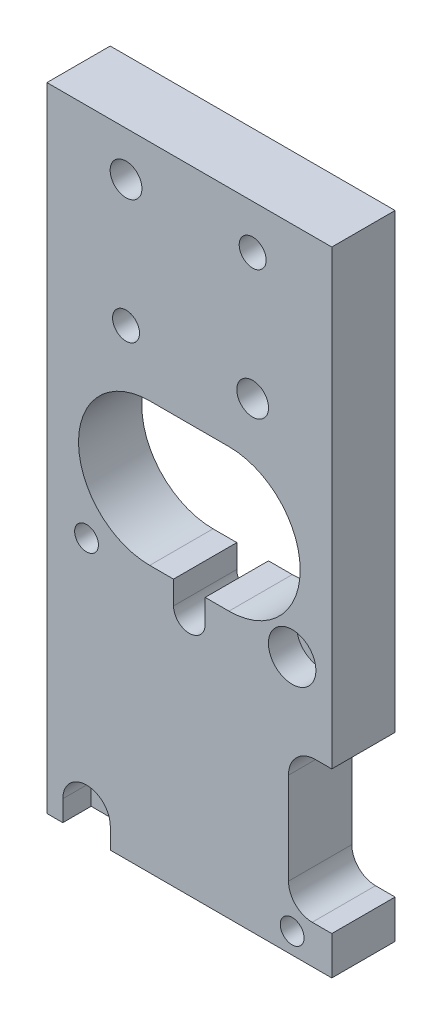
ISO-10303-21;
HEADER;
FILE_DESCRIPTION(('STEP AP214'),'2;1');
FILE_NAME('part.step','',(''),(''),'','','');
FILE_SCHEMA(('AUTOMOTIVE_DESIGN { 1 0 10303 214 1 1 1 1 }'));
ENDSEC;
DATA;
#1=APPLICATION_CONTEXT('core data for automotive mechanical design processes');
#2=APPLICATION_PROTOCOL_DEFINITION('international standard','automotive_design',2000,#1);
#3=PRODUCT_CONTEXT('',#1,'mechanical');
#4=PRODUCT('Part','Part','',(#3));
#5=PRODUCT_RELATED_PRODUCT_CATEGORY('part','',(#4));
#6=PRODUCT_DEFINITION_FORMATION('','',#4);
#7=PRODUCT_DEFINITION_CONTEXT('part definition',#1,'design');
#8=PRODUCT_DEFINITION('design','',#6,#7);
#9=PRODUCT_DEFINITION_SHAPE('','',#8);
#10=(LENGTH_UNIT() NAMED_UNIT(*) SI_UNIT(.MILLI.,.METRE.));
#11=(NAMED_UNIT(*) PLANE_ANGLE_UNIT() SI_UNIT($,.RADIAN.));
#12=(NAMED_UNIT(*) SI_UNIT($,.STERADIAN.) SOLID_ANGLE_UNIT());
#13=UNCERTAINTY_MEASURE_WITH_UNIT(LENGTH_MEASURE(1.E-05),#10,'distance_accuracy_value','');
#14=(GEOMETRIC_REPRESENTATION_CONTEXT(3) GLOBAL_UNCERTAINTY_ASSIGNED_CONTEXT((#13)) GLOBAL_UNIT_ASSIGNED_CONTEXT((#10,
#11,#12)) REPRESENTATION_CONTEXT('',''));
#15=CARTESIAN_POINT('',(0.,0.,0.));
#16=DIRECTION('',(0.,0.,1.));
#17=DIRECTION('',(1.,0.,0.));
#18=AXIS2_PLACEMENT_3D('',#15,#16,#17);
#19=CARTESIAN_POINT('',(14.2875,31.75,-6.35));
#20=DIRECTION('',(1.,0.,0.));
#21=DIRECTION('',(0.,1.,0.));
#22=AXIS2_PLACEMENT_3D('',#19,#20,#21);
#23=PLANE('',#22);
#24=DIRECTION('',(0.,1.,0.));
#25=VECTOR('',#24,1.);
#26=CARTESIAN_POINT('',(14.2875,31.75,0.));
#27=LINE('',#26,#25);
#28=CARTESIAN_POINT('',(14.2875,-13.589,0.));
#29=VERTEX_POINT('',#28);
#30=CARTESIAN_POINT('',(14.2875,31.75,0.));
#31=VERTEX_POINT('',#30);
#32=EDGE_CURVE('E397',#29,#31,#27,.T.);
#33=ORIENTED_EDGE('',*,*,#32,.F.);
#34=DIRECTION('',(0.,0.,1.));
#35=VECTOR('',#34,1.);
#36=CARTESIAN_POINT('',(14.2875,-13.589,-6.35));
#37=LINE('',#36,#35);
#38=CARTESIAN_POINT('',(14.2875,-13.589,-6.35));
#39=VERTEX_POINT('',#38);
#40=EDGE_CURVE('E230',#39,#29,#37,.T.);
#41=ORIENTED_EDGE('',*,*,#40,.F.);
#42=DIRECTION('',(0.,1.,0.));
#43=VECTOR('',#42,1.);
#44=CARTESIAN_POINT('',(14.2875,31.75,-6.35));
#45=LINE('',#44,#43);
#46=CARTESIAN_POINT('',(14.2875,31.75,-6.35));
#47=VERTEX_POINT('',#46);
#48=EDGE_CURVE('E383',#39,#47,#45,.T.);
#49=ORIENTED_EDGE('',*,*,#48,.T.);
#50=DIRECTION('',(0.,0.,1.));
#51=VECTOR('',#50,1.);
#52=CARTESIAN_POINT('',(14.2875,31.75,-6.35));
#53=LINE('',#52,#51);
#54=EDGE_CURVE('E44',#47,#31,#53,.T.);
#55=ORIENTED_EDGE('',*,*,#54,.T.);
#56=EDGE_LOOP('',(#33,#41,#49,#55));
#57=FACE_BOUND('',#56,.T.);
#58=ADVANCED_FACE('F35',(#57),#23,.T.);
#59=CARTESIAN_POINT('',(14.2875,-31.75,-6.35));
#60=VERTEX_POINT('',#59);
#61=CARTESIAN_POINT('',(14.2875,-27.8892,-6.35));
#62=VERTEX_POINT('',#61);
#63=EDGE_CURVE('E384',#60,#62,#45,.T.);
#64=ORIENTED_EDGE('',*,*,#63,.T.);
#65=DIRECTION('',(0.,0.,1.));
#66=VECTOR('',#65,1.);
#67=CARTESIAN_POINT('',(14.2875,-27.8892,-6.35));
#68=LINE('',#67,#66);
#69=CARTESIAN_POINT('',(14.2875,-27.8892,0.));
#70=VERTEX_POINT('',#69);
#71=EDGE_CURVE('E232',#62,#70,#68,.T.);
#72=ORIENTED_EDGE('',*,*,#71,.T.);
#73=CARTESIAN_POINT('',(14.2875,-31.75,0.));
#74=VERTEX_POINT('',#73);
#75=EDGE_CURVE('E398',#74,#70,#27,.T.);
#76=ORIENTED_EDGE('',*,*,#75,.F.);
#77=DIRECTION('',(0.,0.,1.));
#78=VECTOR('',#77,1.);
#79=CARTESIAN_POINT('',(14.2875,-31.75,-6.35));
#80=LINE('',#79,#78);
#81=EDGE_CURVE('E405',#60,#74,#80,.T.);
#82=ORIENTED_EDGE('',*,*,#81,.F.);
#83=EDGE_LOOP('',(#64,#72,#76,#82));
#84=FACE_BOUND('',#83,.T.);
#85=ADVANCED_FACE('F431',(#84),#23,.T.);
#86=CARTESIAN_POINT('',(-14.2875,-31.75,-6.35));
#87=DIRECTION('',(0.,0.,1.));
#88=DIRECTION('',(1.,0.,0.));
#89=AXIS2_PLACEMENT_3D('',#86,#87,#88);
#90=PLANE('',#89);
#91=CARTESIAN_POINT('',(-6.35,27.305,-6.35));
#92=DIRECTION('',(0.,0.,1.));
#93=DIRECTION('',(1.,0.,0.));
#94=AXIS2_PLACEMENT_3D('',#91,#92,#93);
#95=CIRCLE('',#94,1.59385);
#96=CARTESIAN_POINT('',(-4.75615,27.305,-6.35));
#97=VERTEX_POINT('',#96);
#98=EDGE_CURVE('E370',#97,#97,#95,.T.);
#99=ORIENTED_EDGE('',*,*,#98,.T.);
#100=EDGE_LOOP('',(#99));
#101=FACE_BOUND('',#100,.T.);
#102=CARTESIAN_POINT('',(6.35,14.605,-6.35));
#103=DIRECTION('',(0.,0.,1.));
#104=DIRECTION('',(1.,0.,0.));
#105=AXIS2_PLACEMENT_3D('',#102,#103,#104);
#106=CIRCLE('',#105,1.59385);
#107=CARTESIAN_POINT('',(7.94385,14.605,-6.35));
#108=VERTEX_POINT('',#107);
#109=EDGE_CURVE('E364',#108,#108,#106,.T.);
#110=ORIENTED_EDGE('',*,*,#109,.T.);
#111=EDGE_LOOP('',(#110));
#112=FACE_BOUND('',#111,.T.);
#113=DIRECTION('',(1.,0.,0.));
#114=VECTOR('',#113,1.);
#115=CARTESIAN_POINT('',(-1.5875,-5.03554999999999,-6.35));
#116=LINE('',#115,#114);
#117=CARTESIAN_POINT('',(-3.9751,-5.03555,-6.35));
#118=VERTEX_POINT('',#117);
#119=CARTESIAN_POINT('',(-1.5875,-5.03554999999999,-6.35));
#120=VERTEX_POINT('',#119);
#121=EDGE_CURVE('E297',#118,#120,#116,.T.);
#122=ORIENTED_EDGE('',*,*,#121,.T.);
#123=DIRECTION('',(0.,-1.,0.));
#124=VECTOR('',#123,1.);
#125=CARTESIAN_POINT('',(-1.5875,-7.36599999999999,-6.35));
#126=LINE('',#125,#124);
#127=CARTESIAN_POINT('',(-1.5875,-7.36599999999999,-6.35));
#128=VERTEX_POINT('',#127);
#129=EDGE_CURVE('E300',#120,#128,#126,.T.);
#130=ORIENTED_EDGE('',*,*,#129,.T.);
#131=CARTESIAN_POINT('',(0.,-7.36599999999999,-6.35));
#132=DIRECTION('',(0.,0.,1.));
#133=DIRECTION('',(1.,0.,0.));
#134=AXIS2_PLACEMENT_3D('',#131,#132,#133);
#135=CIRCLE('',#134,1.5875);
#136=CARTESIAN_POINT('',(1.5875,-7.36599999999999,-6.35));
#137=VERTEX_POINT('',#136);
#138=EDGE_CURVE('E358',#128,#137,#135,.T.);
#139=ORIENTED_EDGE('',*,*,#138,.T.);
#140=DIRECTION('',(0.,1.,0.));
#141=VECTOR('',#140,1.);
#142=CARTESIAN_POINT('',(1.5875,-7.36599999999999,-6.35));
#143=LINE('',#142,#141);
#144=CARTESIAN_POINT('',(1.5875,-5.03554999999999,-6.35));
#145=VERTEX_POINT('',#144);
#146=EDGE_CURVE('E281',#137,#145,#143,.T.);
#147=ORIENTED_EDGE('',*,*,#146,.T.);
#148=DIRECTION('',(1.,0.,0.));
#149=VECTOR('',#148,1.);
#150=CARTESIAN_POINT('',(3.9751,-5.03554999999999,-6.35));
#151=LINE('',#150,#149);
#152=CARTESIAN_POINT('',(3.9751,-5.03555000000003,-6.35));
#153=VERTEX_POINT('',#152);
#154=EDGE_CURVE('E284',#145,#153,#151,.T.);
#155=ORIENTED_EDGE('',*,*,#154,.T.);
#156=CARTESIAN_POINT('',(3.9751,2.1082,-6.35));
#157=DIRECTION('',(0.,0.,1.));
#158=DIRECTION('',(1.,0.,0.));
#159=AXIS2_PLACEMENT_3D('',#156,#157,#158);
#160=CIRCLE('',#159,7.14375000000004);
#161=CARTESIAN_POINT('',(3.9751,9.25195000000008,-6.35));
#162=VERTEX_POINT('',#161);
#163=EDGE_CURVE('E288',#153,#162,#160,.T.);
#164=ORIENTED_EDGE('',*,*,#163,.T.);
#165=DIRECTION('',(-1.,0.,0.));
#166=VECTOR('',#165,1.);
#167=CARTESIAN_POINT('',(-3.9751,9.25195000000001,-6.35));
#168=LINE('',#167,#166);
#169=CARTESIAN_POINT('',(-3.9751,9.25195000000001,-6.35));
#170=VERTEX_POINT('',#169);
#171=EDGE_CURVE('E291',#162,#170,#168,.T.);
#172=ORIENTED_EDGE('',*,*,#171,.T.);
#173=CARTESIAN_POINT('',(-3.9751,2.1082,-6.35));
#174=DIRECTION('',(0.,0.,1.));
#175=DIRECTION('',(1.,0.,0.));
#176=AXIS2_PLACEMENT_3D('',#173,#174,#175);
#177=CIRCLE('',#176,7.14375);
#178=EDGE_CURVE('E294',#170,#118,#177,.T.);
#179=ORIENTED_EDGE('',*,*,#178,.T.);
#180=EDGE_LOOP('',(#122,#130,#139,#147,#155,#164,#172,#179));
#181=FACE_BOUND('',#180,.T.);
#182=CARTESIAN_POINT('',(-10.3124,-5.842,-6.35));
#183=DIRECTION('',(0.,0.,1.));
#184=DIRECTION('',(1.,0.,0.));
#185=AXIS2_PLACEMENT_3D('',#182,#183,#184);
#186=CIRCLE('',#185,1.1938);
#187=CARTESIAN_POINT('',(-9.1186,-5.842,-6.35));
#188=VERTEX_POINT('',#187);
#189=EDGE_CURVE('E352',#188,#188,#186,.T.);
#190=ORIENTED_EDGE('',*,*,#189,.T.);
#191=EDGE_LOOP('',(#190));
#192=FACE_BOUND('',#191,.T.);
#193=CARTESIAN_POINT('',(10.3124,-29.6672,-6.35));
#194=DIRECTION('',(0.,0.,1.));
#195=DIRECTION('',(1.,0.,0.));
#196=AXIS2_PLACEMENT_3D('',#193,#194,#195);
#197=CIRCLE('',#196,1.1938);
#198=CARTESIAN_POINT('',(11.5062,-29.6672,-6.35));
#199=VERTEX_POINT('',#198);
#200=EDGE_CURVE('E346',#199,#199,#197,.T.);
#201=ORIENTED_EDGE('',*,*,#200,.T.);
#202=EDGE_LOOP('',(#201));
#203=FACE_BOUND('',#202,.T.);
#204=CARTESIAN_POINT('',(10.3124,-5.842,-6.35));
#205=DIRECTION('',(0.,0.,1.));
#206=DIRECTION('',(1.,0.,0.));
#207=AXIS2_PLACEMENT_3D('',#204,#205,#206);
#208=CIRCLE('',#207,1.4351);
#209=CARTESIAN_POINT('',(11.7475,-5.842,-6.35));
#210=VERTEX_POINT('',#209);
#211=EDGE_CURVE('E342',#210,#210,#208,.T.);
#212=ORIENTED_EDGE('',*,*,#211,.T.);
#213=EDGE_LOOP('',(#212));
#214=FACE_BOUND('',#213,.T.);
#215=CARTESIAN_POINT('',(-10.3124,-29.6672,-6.35));
#216=DIRECTION('',(0.,0.,1.));
#217=DIRECTION('',(1.,0.,0.));
#218=AXIS2_PLACEMENT_3D('',#215,#216,#217);
#219=CIRCLE('',#218,1.4351);
#220=CARTESIAN_POINT('',(-8.8773,-29.6672,-6.35));
#221=VERTEX_POINT('',#220);
#222=EDGE_CURVE('E326',#221,#221,#219,.T.);
#223=ORIENTED_EDGE('',*,*,#222,.T.);
#224=EDGE_LOOP('',(#223));
#225=FACE_BOUND('',#224,.T.);
#226=CARTESIAN_POINT('',(6.35,27.305,-6.35));
#227=DIRECTION('',(0.,0.,1.));
#228=DIRECTION('',(1.,0.,0.));
#229=AXIS2_PLACEMENT_3D('',#226,#227,#228);
#230=CIRCLE('',#229,1.35255);
#231=CARTESIAN_POINT('',(7.70255,27.305,-6.35));
#232=VERTEX_POINT('',#231);
#233=EDGE_CURVE('E241',#232,#232,#230,.T.);
#234=ORIENTED_EDGE('',*,*,#233,.T.);
#235=EDGE_LOOP('',(#234));
#236=FACE_BOUND('',#235,.T.);
#237=CARTESIAN_POINT('',(-6.35,14.605,-6.35));
#238=DIRECTION('',(0.,0.,1.));
#239=DIRECTION('',(1.,0.,0.));
#240=AXIS2_PLACEMENT_3D('',#237,#238,#239);
#241=CIRCLE('',#240,1.35255);
#242=CARTESIAN_POINT('',(-4.99745,14.605,-6.35));
#243=VERTEX_POINT('',#242);
#244=EDGE_CURVE('E227',#243,#243,#241,.T.);
#245=ORIENTED_EDGE('',*,*,#244,.T.);
#246=EDGE_LOOP('',(#245));
#247=FACE_BOUND('',#246,.T.);
#248=DIRECTION('',(1.,0.,0.));
#249=VECTOR('',#248,1.);
#250=CARTESIAN_POINT('',(0.,-13.5889999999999,-6.35));
#251=LINE('',#250,#249);
#252=CARTESIAN_POINT('',(12.6609873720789,-13.589,-6.35));
#253=VERTEX_POINT('',#252);
#254=EDGE_CURVE('E214',#253,#39,#251,.T.);
#255=ORIENTED_EDGE('',*,*,#254,.F.);
#256=CARTESIAN_POINT('',(12.6576066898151,-16.3025045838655,-6.35));
#257=DIRECTION('',(0.,0.,1.));
#258=DIRECTION('',(1.,0.,0.));
#259=AXIS2_PLACEMENT_3D('',#256,#257,#258);
#260=CIRCLE('',#259,2.71350668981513);
#261=CARTESIAN_POINT('',(9.94410000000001,-16.3025045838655,-6.35));
#262=VERTEX_POINT('',#261);
#263=EDGE_CURVE('E194',#253,#262,#260,.T.);
#264=ORIENTED_EDGE('',*,*,#263,.T.);
#265=DIRECTION('',(0.,-1.,0.));
#266=VECTOR('',#265,1.);
#267=CARTESIAN_POINT('',(9.94410000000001,0.,-6.35));
#268=LINE('',#267,#266);
#269=CARTESIAN_POINT('',(9.94410000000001,-25.50922,-6.35));
#270=VERTEX_POINT('',#269);
#271=EDGE_CURVE('E188',#262,#270,#268,.T.);
#272=ORIENTED_EDGE('',*,*,#271,.T.);
#273=CARTESIAN_POINT('',(12.32408,-25.50922,-6.35));
#274=DIRECTION('',(0.,0.,1.));
#275=DIRECTION('',(1.,0.,0.));
#276=AXIS2_PLACEMENT_3D('',#273,#274,#275);
#277=CIRCLE('',#276,2.37998);
#278=CARTESIAN_POINT('',(12.32408,-27.8892,-6.35));
#279=VERTEX_POINT('',#278);
#280=EDGE_CURVE('E198',#270,#279,#277,.T.);
#281=ORIENTED_EDGE('',*,*,#280,.T.);
#282=DIRECTION('',(-1.,0.,0.));
#283=VECTOR('',#282,1.);
#284=CARTESIAN_POINT('',(0.,-27.8892,-6.35));
#285=LINE('',#284,#283);
#286=EDGE_CURVE('E202',#62,#279,#285,.T.);
#287=ORIENTED_EDGE('',*,*,#286,.F.);
#288=ORIENTED_EDGE('',*,*,#63,.F.);
#289=DIRECTION('',(1.,0.,0.));
#290=VECTOR('',#289,1.);
#291=CARTESIAN_POINT('',(-14.2875,-31.75,-6.35));
#292=LINE('',#291,#290);
#293=CARTESIAN_POINT('',(-14.2875,-31.75,-6.35));
#294=VERTEX_POINT('',#293);
#295=EDGE_CURVE('E379',#294,#60,#292,.T.);
#296=ORIENTED_EDGE('',*,*,#295,.F.);
#297=DIRECTION('',(0.,-1.,0.));
#298=VECTOR('',#297,1.);
#299=CARTESIAN_POINT('',(-14.2875,31.75,-6.35));
#300=LINE('',#299,#298);
#301=CARTESIAN_POINT('',(-14.2875,31.75,-6.35));
#302=VERTEX_POINT('',#301);
#303=EDGE_CURVE('E376',#302,#294,#300,.T.);
#304=ORIENTED_EDGE('',*,*,#303,.F.);
#305=DIRECTION('',(-1.,0.,0.));
#306=VECTOR('',#305,1.);
#307=CARTESIAN_POINT('',(-14.2875,31.75,-6.35));
#308=LINE('',#307,#306);
#309=EDGE_CURVE('E387',#47,#302,#308,.T.);
#310=ORIENTED_EDGE('',*,*,#309,.F.);
#311=ORIENTED_EDGE('',*,*,#48,.F.);
#312=EDGE_LOOP('',(#255,#264,#272,#281,#287,#288,#296,#304,#310,#311));
#313=FACE_BOUND('',#312,.T.);
#314=ADVANCED_FACE('F205',(#101,#112,#181,#192,#203,#214,#225,#236,#247,#313),#90,.F.);
#315=CARTESIAN_POINT('',(-14.2875,-31.75,0.));
#316=DIRECTION('',(0.,0.,1.));
#317=DIRECTION('',(1.,0.,0.));
#318=AXIS2_PLACEMENT_3D('',#315,#316,#317);
#319=PLANE('',#318);
#320=CARTESIAN_POINT('',(-6.35,27.305,0.));
#321=DIRECTION('',(0.,0.,1.));
#322=DIRECTION('',(1.,0.,0.));
#323=AXIS2_PLACEMENT_3D('',#320,#321,#322);
#324=CIRCLE('',#323,1.59385);
#325=CARTESIAN_POINT('',(-4.75615,27.305,0.));
#326=VERTEX_POINT('',#325);
#327=EDGE_CURVE('E367',#326,#326,#324,.T.);
#328=ORIENTED_EDGE('',*,*,#327,.F.);
#329=EDGE_LOOP('',(#328));
#330=FACE_BOUND('',#329,.T.);
#331=CARTESIAN_POINT('',(6.35,14.605,0.));
#332=DIRECTION('',(0.,0.,1.));
#333=DIRECTION('',(1.,0.,0.));
#334=AXIS2_PLACEMENT_3D('',#331,#332,#333);
#335=CIRCLE('',#334,1.59385);
#336=CARTESIAN_POINT('',(7.94385,14.605,0.));
#337=VERTEX_POINT('',#336);
#338=EDGE_CURVE('E361',#337,#337,#335,.T.);
#339=ORIENTED_EDGE('',*,*,#338,.F.);
#340=EDGE_LOOP('',(#339));
#341=FACE_BOUND('',#340,.T.);
#342=CARTESIAN_POINT('',(-10.3124,-5.842,0.));
#343=DIRECTION('',(0.,0.,1.));
#344=DIRECTION('',(1.,0.,0.));
#345=AXIS2_PLACEMENT_3D('',#342,#343,#344);
#346=CIRCLE('',#345,1.1938);
#347=CARTESIAN_POINT('',(-9.1186,-5.842,0.));
#348=VERTEX_POINT('',#347);
#349=EDGE_CURVE('E349',#348,#348,#346,.T.);
#350=ORIENTED_EDGE('',*,*,#349,.F.);
#351=EDGE_LOOP('',(#350));
#352=FACE_BOUND('',#351,.T.);
#353=CARTESIAN_POINT('',(10.3124,-29.6672,0.));
#354=DIRECTION('',(0.,0.,1.));
#355=DIRECTION('',(1.,0.,0.));
#356=AXIS2_PLACEMENT_3D('',#353,#354,#355);
#357=CIRCLE('',#356,1.1938);
#358=CARTESIAN_POINT('',(11.5062,-29.6672,0.));
#359=VERTEX_POINT('',#358);
#360=EDGE_CURVE('E345',#359,#359,#357,.T.);
#361=ORIENTED_EDGE('',*,*,#360,.F.);
#362=EDGE_LOOP('',(#361));
#363=FACE_BOUND('',#362,.T.);
#364=DIRECTION('',(0.,-1.,0.));
#365=VECTOR('',#364,1.);
#366=CARTESIAN_POINT('',(-1.5875,-7.36599999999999,0.));
#367=LINE('',#366,#365);
#368=CARTESIAN_POINT('',(-1.5875,-5.03554999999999,0.));
#369=VERTEX_POINT('',#368);
#370=CARTESIAN_POINT('',(-1.5875,-7.36599999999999,0.));
#371=VERTEX_POINT('',#370);
#372=EDGE_CURVE('E285',#369,#371,#367,.T.);
#373=ORIENTED_EDGE('',*,*,#372,.F.);
#374=DIRECTION('',(1.,0.,0.));
#375=VECTOR('',#374,1.);
#376=CARTESIAN_POINT('',(-1.5875,-5.03554999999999,0.));
#377=LINE('',#376,#375);
#378=CARTESIAN_POINT('',(-3.9751,-5.03555,0.));
#379=VERTEX_POINT('',#378);
#380=EDGE_CURVE('E319',#379,#369,#377,.T.);
#381=ORIENTED_EDGE('',*,*,#380,.F.);
#382=CARTESIAN_POINT('',(-3.9751,2.1082,0.));
#383=DIRECTION('',(0.,0.,1.));
#384=DIRECTION('',(1.,0.,0.));
#385=AXIS2_PLACEMENT_3D('',#382,#383,#384);
#386=CIRCLE('',#385,7.14375);
#387=CARTESIAN_POINT('',(-3.9751,9.25195000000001,0.));
#388=VERTEX_POINT('',#387);
#389=EDGE_CURVE('E316',#388,#379,#386,.T.);
#390=ORIENTED_EDGE('',*,*,#389,.F.);
#391=DIRECTION('',(-1.,0.,0.));
#392=VECTOR('',#391,1.);
#393=CARTESIAN_POINT('',(-3.9751,9.25195000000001,0.));
#394=LINE('',#393,#392);
#395=CARTESIAN_POINT('',(3.9751,9.25195000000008,0.));
#396=VERTEX_POINT('',#395);
#397=EDGE_CURVE('E313',#396,#388,#394,.T.);
#398=ORIENTED_EDGE('',*,*,#397,.F.);
#399=CARTESIAN_POINT('',(3.9751,2.1082,0.));
#400=DIRECTION('',(0.,0.,1.));
#401=DIRECTION('',(1.,0.,0.));
#402=AXIS2_PLACEMENT_3D('',#399,#400,#401);
#403=CIRCLE('',#402,7.14375000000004);
#404=CARTESIAN_POINT('',(3.9751,-5.03555000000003,0.));
#405=VERTEX_POINT('',#404);
#406=EDGE_CURVE('E310',#405,#396,#403,.T.);
#407=ORIENTED_EDGE('',*,*,#406,.F.);
#408=DIRECTION('',(1.,0.,0.));
#409=VECTOR('',#408,1.);
#410=CARTESIAN_POINT('',(3.9751,-5.03554999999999,0.));
#411=LINE('',#410,#409);
#412=CARTESIAN_POINT('',(1.5875,-5.03554999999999,0.));
#413=VERTEX_POINT('',#412);
#414=EDGE_CURVE('E307',#413,#405,#411,.T.);
#415=ORIENTED_EDGE('',*,*,#414,.F.);
#416=DIRECTION('',(0.,1.,0.));
#417=VECTOR('',#416,1.);
#418=CARTESIAN_POINT('',(1.5875,-7.36599999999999,0.));
#419=LINE('',#418,#417);
#420=CARTESIAN_POINT('',(1.5875,-7.36599999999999,0.));
#421=VERTEX_POINT('',#420);
#422=EDGE_CURVE('E304',#421,#413,#419,.T.);
#423=ORIENTED_EDGE('',*,*,#422,.F.);
#424=CARTESIAN_POINT('',(0.,-7.36599999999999,0.));
#425=DIRECTION('',(0.,0.,1.));
#426=DIRECTION('',(1.,0.,0.));
#427=AXIS2_PLACEMENT_3D('',#424,#425,#426);
#428=CIRCLE('',#427,1.5875);
#429=EDGE_CURVE('E355',#371,#421,#428,.T.);
#430=ORIENTED_EDGE('',*,*,#429,.F.);
#431=EDGE_LOOP('',(#373,#381,#390,#398,#407,#415,#423,#430));
#432=FACE_BOUND('',#431,.T.);
#433=CARTESIAN_POINT('',(10.3124,-5.842,0.));
#434=DIRECTION('',(0.,0.,1.));
#435=DIRECTION('',(1.,0.,0.));
#436=AXIS2_PLACEMENT_3D('',#433,#434,#435);
#437=CIRCLE('',#436,2.38125);
#438=CARTESIAN_POINT('',(12.69365,-5.842,0.));
#439=VERTEX_POINT('',#438);
#440=EDGE_CURVE('E247',#439,#439,#437,.T.);
#441=ORIENTED_EDGE('',*,*,#440,.F.);
#442=EDGE_LOOP('',(#441));
#443=FACE_BOUND('',#442,.T.);
#444=CARTESIAN_POINT('',(6.35,27.305,0.));
#445=DIRECTION('',(0.,0.,1.));
#446=DIRECTION('',(1.,0.,0.));
#447=AXIS2_PLACEMENT_3D('',#444,#445,#446);
#448=CIRCLE('',#447,1.35254999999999);
#449=CARTESIAN_POINT('',(7.70254999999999,27.305,0.));
#450=VERTEX_POINT('',#449);
#451=EDGE_CURVE('E244',#450,#450,#448,.T.);
#452=ORIENTED_EDGE('',*,*,#451,.F.);
#453=EDGE_LOOP('',(#452));
#454=FACE_BOUND('',#453,.T.);
#455=CARTESIAN_POINT('',(-6.35,14.605,0.));
#456=DIRECTION('',(0.,0.,1.));
#457=DIRECTION('',(1.,0.,0.));
#458=AXIS2_PLACEMENT_3D('',#455,#456,#457);
#459=CIRCLE('',#458,1.35254999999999);
#460=CARTESIAN_POINT('',(-4.99745000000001,14.605,0.));
#461=VERTEX_POINT('',#460);
#462=EDGE_CURVE('E238',#461,#461,#459,.T.);
#463=ORIENTED_EDGE('',*,*,#462,.F.);
#464=EDGE_LOOP('',(#463));
#465=FACE_BOUND('',#464,.T.);
#466=CARTESIAN_POINT('',(12.6576066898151,-16.3025045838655,0.));
#467=DIRECTION('',(0.,0.,1.));
#468=DIRECTION('',(1.,0.,0.));
#469=AXIS2_PLACEMENT_3D('',#466,#467,#468);
#470=CIRCLE('',#469,2.71350668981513);
#471=CARTESIAN_POINT('',(12.6609873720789,-13.589,0.));
#472=VERTEX_POINT('',#471);
#473=CARTESIAN_POINT('',(9.94410000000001,-16.3025045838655,0.));
#474=VERTEX_POINT('',#473);
#475=EDGE_CURVE('E207',#472,#474,#470,.T.);
#476=ORIENTED_EDGE('',*,*,#475,.F.);
#477=DIRECTION('',(1.,0.,0.));
#478=VECTOR('',#477,1.);
#479=CARTESIAN_POINT('',(0.,-13.5889999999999,0.));
#480=LINE('',#479,#478);
#481=EDGE_CURVE('E210',#472,#29,#480,.T.);
#482=ORIENTED_EDGE('',*,*,#481,.T.);
#483=ORIENTED_EDGE('',*,*,#32,.T.);
#484=DIRECTION('',(-1.,0.,0.));
#485=VECTOR('',#484,1.);
#486=CARTESIAN_POINT('',(-14.2875,31.75,0.));
#487=LINE('',#486,#485);
#488=CARTESIAN_POINT('',(-14.2875,31.75,0.));
#489=VERTEX_POINT('',#488);
#490=EDGE_CURVE('E380',#31,#489,#487,.T.);
#491=ORIENTED_EDGE('',*,*,#490,.T.);
#492=DIRECTION('',(0.,-1.,0.));
#493=VECTOR('',#492,1.);
#494=CARTESIAN_POINT('',(-14.2875,31.75,0.));
#495=LINE('',#494,#493);
#496=CARTESIAN_POINT('',(-14.2875,-31.75,0.));
#497=VERTEX_POINT('',#496);
#498=EDGE_CURVE('E373',#489,#497,#495,.T.);
#499=ORIENTED_EDGE('',*,*,#498,.T.);
#500=DIRECTION('',(1.,0.,0.));
#501=VECTOR('',#500,1.);
#502=CARTESIAN_POINT('',(-14.2875,-31.75,0.));
#503=LINE('',#502,#501);
#504=CARTESIAN_POINT('',(-12.69365,-31.75,0.));
#505=VERTEX_POINT('',#504);
#506=EDGE_CURVE('E394',#497,#505,#503,.T.);
#507=ORIENTED_EDGE('',*,*,#506,.T.);
#508=DIRECTION('',(0.,-1.,0.));
#509=VECTOR('',#508,1.);
#510=CARTESIAN_POINT('',(-12.69365,-29.6672,0.));
#511=LINE('',#510,#509);
#512=CARTESIAN_POINT('',(-12.69365,-29.6672,0.));
#513=VERTEX_POINT('',#512);
#514=EDGE_CURVE('E257',#513,#505,#511,.T.);
#515=ORIENTED_EDGE('',*,*,#514,.F.);
#516=CARTESIAN_POINT('',(-10.3124,-29.6672,0.));
#517=DIRECTION('',(0.,0.,1.));
#518=DIRECTION('',(1.,0.,0.));
#519=AXIS2_PLACEMENT_3D('',#516,#517,#518);
#520=CIRCLE('',#519,2.38125);
#521=CARTESIAN_POINT('',(-7.93115,-29.6672,0.));
#522=VERTEX_POINT('',#521);
#523=EDGE_CURVE('E268',#522,#513,#520,.T.);
#524=ORIENTED_EDGE('',*,*,#523,.F.);
#525=DIRECTION('',(0.,1.,0.));
#526=VECTOR('',#525,1.);
#527=CARTESIAN_POINT('',(-7.93115,-31.75,0.));
#528=LINE('',#527,#526);
#529=CARTESIAN_POINT('',(-7.93115,-31.75,0.));
#530=VERTEX_POINT('',#529);
#531=EDGE_CURVE('E266',#530,#522,#528,.T.);
#532=ORIENTED_EDGE('',*,*,#531,.F.);
#533=EDGE_CURVE('E393',#530,#74,#503,.T.);
#534=ORIENTED_EDGE('',*,*,#533,.T.);
#535=ORIENTED_EDGE('',*,*,#75,.T.);
#536=DIRECTION('',(-1.,0.,0.));
#537=VECTOR('',#536,1.);
#538=CARTESIAN_POINT('',(0.,-27.8892,0.));
#539=LINE('',#538,#537);
#540=CARTESIAN_POINT('',(12.32408,-27.8892,0.));
#541=VERTEX_POINT('',#540);
#542=EDGE_CURVE('E220',#70,#541,#539,.T.);
#543=ORIENTED_EDGE('',*,*,#542,.T.);
#544=CARTESIAN_POINT('',(12.32408,-25.50922,0.));
#545=DIRECTION('',(0.,0.,1.));
#546=DIRECTION('',(1.,0.,0.));
#547=AXIS2_PLACEMENT_3D('',#544,#545,#546);
#548=CIRCLE('',#547,2.37998);
#549=CARTESIAN_POINT('',(9.94410000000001,-25.50922,0.));
#550=VERTEX_POINT('',#549);
#551=EDGE_CURVE('E218',#550,#541,#548,.T.);
#552=ORIENTED_EDGE('',*,*,#551,.F.);
#553=DIRECTION('',(0.,-1.,0.));
#554=VECTOR('',#553,1.);
#555=CARTESIAN_POINT('',(9.94410000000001,0.,0.));
#556=LINE('',#555,#554);
#557=EDGE_CURVE('E52',#474,#550,#556,.T.);
#558=ORIENTED_EDGE('',*,*,#557,.F.);
#559=EDGE_LOOP('',(#476,#482,#483,#491,#499,#507,#515,#524,#532,#534,#535,#543,#552,#558));
#560=FACE_BOUND('',#559,.T.);
#561=ADVANCED_FACE('F425',(#330,#341,#352,#363,#432,#443,#454,#465,#560),#319,.T.);
#562=CARTESIAN_POINT('',(10.3124,-5.842,-6.35));
#563=DIRECTION('',(0.,0.,1.));
#564=DIRECTION('',(1.,0.,0.));
#565=AXIS2_PLACEMENT_3D('',#562,#563,#564);
#566=CYLINDRICAL_SURFACE('',#565,1.4351);
#567=ORIENTED_EDGE('',*,*,#211,.F.);
#568=EDGE_LOOP('',(#567));
#569=FACE_BOUND('',#568,.T.);
#570=CARTESIAN_POINT('',(10.3124,-5.842,-2.8448));
#571=DIRECTION('',(0.,0.,1.));
#572=DIRECTION('',(1.,0.,0.));
#573=AXIS2_PLACEMENT_3D('',#570,#571,#572);
#574=CIRCLE('',#573,1.4351);
#575=CARTESIAN_POINT('',(11.7475,-5.842,-2.8448));
#576=VERTEX_POINT('',#575);
#577=EDGE_CURVE('E39',#576,#576,#574,.F.);
#578=ORIENTED_EDGE('',*,*,#577,.F.);
#579=EDGE_LOOP('',(#578));
#580=FACE_BOUND('',#579,.T.);
#581=ADVANCED_FACE('F416',(#569,#580),#566,.F.);
#582=CARTESIAN_POINT('',(-10.3124,-29.6672,-6.35));
#583=DIRECTION('',(0.,0.,1.));
#584=DIRECTION('',(1.,0.,0.));
#585=AXIS2_PLACEMENT_3D('',#582,#583,#584);
#586=CYLINDRICAL_SURFACE('',#585,1.4351);
#587=ORIENTED_EDGE('',*,*,#222,.F.);
#588=EDGE_LOOP('',(#587));
#589=FACE_BOUND('',#588,.T.);
#590=CARTESIAN_POINT('',(-10.3124,-29.6672,-2.8448));
#591=DIRECTION('',(0.,0.,1.));
#592=DIRECTION('',(1.,0.,0.));
#593=AXIS2_PLACEMENT_3D('',#590,#591,#592);
#594=CIRCLE('',#593,1.4351);
#595=CARTESIAN_POINT('',(-8.8773,-29.6672,-2.8448));
#596=VERTEX_POINT('',#595);
#597=EDGE_CURVE('E275',#596,#596,#594,.F.);
#598=ORIENTED_EDGE('',*,*,#597,.F.);
#599=EDGE_LOOP('',(#598));
#600=FACE_BOUND('',#599,.T.);
#601=ADVANCED_FACE('F413',(#589,#600),#586,.F.);
#602=CARTESIAN_POINT('',(0.,-7.36599999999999,-6.35));
#603=DIRECTION('',(0.,0.,1.));
#604=DIRECTION('',(1.,0.,0.));
#605=AXIS2_PLACEMENT_3D('',#602,#603,#604);
#606=CYLINDRICAL_SURFACE('',#605,1.5875);
#607=DIRECTION('',(0.,0.,1.));
#608=VECTOR('',#607,1.);
#609=CARTESIAN_POINT('',(-1.5875,-7.36599999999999,-6.35));
#610=LINE('',#609,#608);
#611=EDGE_CURVE('E323',#128,#371,#610,.T.);
#612=ORIENTED_EDGE('',*,*,#611,.T.);
#613=ORIENTED_EDGE('',*,*,#429,.T.);
#614=DIRECTION('',(0.,0.,1.));
#615=VECTOR('',#614,1.);
#616=CARTESIAN_POINT('',(1.5875,-7.36599999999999,-6.35));
#617=LINE('',#616,#615);
#618=EDGE_CURVE('E303',#137,#421,#617,.T.);
#619=ORIENTED_EDGE('',*,*,#618,.F.);
#620=ORIENTED_EDGE('',*,*,#138,.F.);
#621=EDGE_LOOP('',(#612,#613,#619,#620));
#622=FACE_BOUND('',#621,.T.);
#623=ADVANCED_FACE('F415',(#622),#606,.F.);
#624=CARTESIAN_POINT('',(-14.2875,31.75,-6.35));
#625=DIRECTION('',(-1.,0.,0.));
#626=DIRECTION('',(0.,-1.,0.));
#627=AXIS2_PLACEMENT_3D('',#624,#625,#626);
#628=PLANE('',#627);
#629=ORIENTED_EDGE('',*,*,#498,.F.);
#630=DIRECTION('',(0.,0.,1.));
#631=VECTOR('',#630,1.);
#632=CARTESIAN_POINT('',(-14.2875,31.75,-6.35));
#633=LINE('',#632,#631);
#634=EDGE_CURVE('E11',#302,#489,#633,.T.);
#635=ORIENTED_EDGE('',*,*,#634,.F.);
#636=ORIENTED_EDGE('',*,*,#303,.T.);
#637=DIRECTION('',(0.,0.,1.));
#638=VECTOR('',#637,1.);
#639=CARTESIAN_POINT('',(-14.2875,-31.75,-6.35));
#640=LINE('',#639,#638);
#641=EDGE_CURVE('E390',#294,#497,#640,.T.);
#642=ORIENTED_EDGE('',*,*,#641,.T.);
#643=EDGE_LOOP('',(#629,#635,#636,#642));
#644=FACE_BOUND('',#643,.T.);
#645=ADVANCED_FACE('F37',(#644),#628,.T.);
#646=CARTESIAN_POINT('',(-14.2875,31.75,-6.35));
#647=DIRECTION('',(0.,1.,0.));
#648=DIRECTION('',(-1.,0.,0.));
#649=AXIS2_PLACEMENT_3D('',#646,#647,#648);
#650=PLANE('',#649);
#651=ORIENTED_EDGE('',*,*,#490,.F.);
#652=ORIENTED_EDGE('',*,*,#54,.F.);
#653=ORIENTED_EDGE('',*,*,#309,.T.);
#654=ORIENTED_EDGE('',*,*,#634,.T.);
#655=EDGE_LOOP('',(#651,#652,#653,#654));
#656=FACE_BOUND('',#655,.T.);
#657=ADVANCED_FACE('F440',(#656),#650,.T.);
#658=CARTESIAN_POINT('',(-14.2875,-31.75,-6.35));
#659=DIRECTION('',(0.,-1.,0.));
#660=DIRECTION('',(0.,0.,-1.));
#661=AXIS2_PLACEMENT_3D('',#658,#659,#660);
#662=PLANE('',#661);
#663=DIRECTION('',(0.,0.,1.));
#664=VECTOR('',#663,1.);
#665=CARTESIAN_POINT('',(-12.69365,-31.75,-2.8448));
#666=LINE('',#665,#664);
#667=CARTESIAN_POINT('',(-12.69365,-31.75,-2.8448));
#668=VERTEX_POINT('',#667);
#669=EDGE_CURVE('E272',#668,#505,#666,.T.);
#670=ORIENTED_EDGE('',*,*,#669,.T.);
#671=ORIENTED_EDGE('',*,*,#506,.F.);
#672=ORIENTED_EDGE('',*,*,#641,.F.);
#673=ORIENTED_EDGE('',*,*,#295,.T.);
#674=ORIENTED_EDGE('',*,*,#81,.T.);
#675=ORIENTED_EDGE('',*,*,#533,.F.);
#676=DIRECTION('',(0.,0.,1.));
#677=VECTOR('',#676,1.);
#678=CARTESIAN_POINT('',(-7.93115,-31.75,-2.8448));
#679=LINE('',#678,#677);
#680=CARTESIAN_POINT('',(-7.93115,-31.75,-2.8448));
#681=VERTEX_POINT('',#680);
#682=EDGE_CURVE('E60',#681,#530,#679,.T.);
#683=ORIENTED_EDGE('',*,*,#682,.F.);
#684=DIRECTION('',(1.,0.,0.));
#685=VECTOR('',#684,1.);
#686=CARTESIAN_POINT('',(-12.69365,-31.75,-2.8448));
#687=LINE('',#686,#685);
#688=EDGE_CURVE('E253',#668,#681,#687,.T.);
#689=ORIENTED_EDGE('',*,*,#688,.F.);
#690=EDGE_LOOP('',(#670,#671,#672,#673,#674,#675,#683,#689));
#691=FACE_BOUND('',#690,.T.);
#692=ADVANCED_FACE('F442',(#691),#662,.T.);
#693=CARTESIAN_POINT('',(-6.35,27.305,-6.35));
#694=DIRECTION('',(0.,0.,1.));
#695=DIRECTION('',(1.,0.,0.));
#696=AXIS2_PLACEMENT_3D('',#693,#694,#695);
#697=CYLINDRICAL_SURFACE('',#696,1.59385);
#698=ORIENTED_EDGE('',*,*,#98,.F.);
#699=EDGE_LOOP('',(#698));
#700=FACE_BOUND('',#699,.T.);
#701=ORIENTED_EDGE('',*,*,#327,.T.);
#702=EDGE_LOOP('',(#701));
#703=FACE_BOUND('',#702,.T.);
#704=ADVANCED_FACE('F444',(#700,#703),#697,.F.);
#705=CARTESIAN_POINT('',(6.35,14.605,-6.35));
#706=DIRECTION('',(0.,0.,1.));
#707=DIRECTION('',(1.,0.,0.));
#708=AXIS2_PLACEMENT_3D('',#705,#706,#707);
#709=CYLINDRICAL_SURFACE('',#708,1.59385);
#710=ORIENTED_EDGE('',*,*,#109,.F.);
#711=EDGE_LOOP('',(#710));
#712=FACE_BOUND('',#711,.T.);
#713=ORIENTED_EDGE('',*,*,#338,.T.);
#714=EDGE_LOOP('',(#713));
#715=FACE_BOUND('',#714,.T.);
#716=ADVANCED_FACE('F450',(#712,#715),#709,.F.);
#717=CARTESIAN_POINT('',(-10.3124,-5.842,-6.35));
#718=DIRECTION('',(0.,0.,1.));
#719=DIRECTION('',(1.,0.,0.));
#720=AXIS2_PLACEMENT_3D('',#717,#718,#719);
#721=CYLINDRICAL_SURFACE('',#720,1.1938);
#722=ORIENTED_EDGE('',*,*,#189,.F.);
#723=EDGE_LOOP('',(#722));
#724=FACE_BOUND('',#723,.T.);
#725=ORIENTED_EDGE('',*,*,#349,.T.);
#726=EDGE_LOOP('',(#725));
#727=FACE_BOUND('',#726,.T.);
#728=ADVANCED_FACE('F568',(#724,#727),#721,.F.);
#729=CARTESIAN_POINT('',(10.3124,-29.6672,-6.35));
#730=DIRECTION('',(0.,0.,1.));
#731=DIRECTION('',(1.,0.,0.));
#732=AXIS2_PLACEMENT_3D('',#729,#730,#731);
#733=CYLINDRICAL_SURFACE('',#732,1.1938);
#734=ORIENTED_EDGE('',*,*,#200,.F.);
#735=EDGE_LOOP('',(#734));
#736=FACE_BOUND('',#735,.T.);
#737=ORIENTED_EDGE('',*,*,#360,.T.);
#738=EDGE_LOOP('',(#737));
#739=FACE_BOUND('',#738,.T.);
#740=ADVANCED_FACE('F495',(#736,#739),#733,.F.);
#741=CARTESIAN_POINT('',(-1.5875,-7.36599999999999,-6.35));
#742=DIRECTION('',(-1.,0.,0.));
#743=DIRECTION('',(0.,-1.,0.));
#744=AXIS2_PLACEMENT_3D('',#741,#742,#743);
#745=PLANE('',#744);
#746=ORIENTED_EDGE('',*,*,#372,.T.);
#747=ORIENTED_EDGE('',*,*,#611,.F.);
#748=ORIENTED_EDGE('',*,*,#129,.F.);
#749=DIRECTION('',(0.,0.,1.));
#750=VECTOR('',#749,1.);
#751=CARTESIAN_POINT('',(-1.5875,-5.03554999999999,-6.35));
#752=LINE('',#751,#750);
#753=EDGE_CURVE('E327',#120,#369,#752,.T.);
#754=ORIENTED_EDGE('',*,*,#753,.T.);
#755=EDGE_LOOP('',(#746,#747,#748,#754));
#756=FACE_BOUND('',#755,.T.);
#757=ADVANCED_FACE('F491',(#756),#745,.F.);
#758=CARTESIAN_POINT('',(-1.5875,-5.03554999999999,-6.35));
#759=DIRECTION('',(0.,-1.,0.));
#760=DIRECTION('',(1.,0.,0.));
#761=AXIS2_PLACEMENT_3D('',#758,#759,#760);
#762=PLANE('',#761);
#763=ORIENTED_EDGE('',*,*,#380,.T.);
#764=ORIENTED_EDGE('',*,*,#753,.F.);
#765=ORIENTED_EDGE('',*,*,#121,.F.);
#766=DIRECTION('',(0.,0.,1.));
#767=VECTOR('',#766,1.);
#768=CARTESIAN_POINT('',(-3.9751,-5.03555,-6.35));
#769=LINE('',#768,#767);
#770=EDGE_CURVE('E329',#118,#379,#769,.T.);
#771=ORIENTED_EDGE('',*,*,#770,.T.);
#772=EDGE_LOOP('',(#763,#764,#765,#771));
#773=FACE_BOUND('',#772,.T.);
#774=ADVANCED_FACE('F494',(#773),#762,.F.);
#775=CARTESIAN_POINT('',(-3.9751,2.1082,-6.35));
#776=DIRECTION('',(0.,0.,1.));
#777=DIRECTION('',(1.,0.,0.));
#778=AXIS2_PLACEMENT_3D('',#775,#776,#777);
#779=CYLINDRICAL_SURFACE('',#778,7.14375);
#780=ORIENTED_EDGE('',*,*,#389,.T.);
#781=ORIENTED_EDGE('',*,*,#770,.F.);
#782=ORIENTED_EDGE('',*,*,#178,.F.);
#783=DIRECTION('',(0.,0.,1.));
#784=VECTOR('',#783,1.);
#785=CARTESIAN_POINT('',(-3.9751,9.25195000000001,-6.35));
#786=LINE('',#785,#784);
#787=EDGE_CURVE('E331',#170,#388,#786,.T.);
#788=ORIENTED_EDGE('',*,*,#787,.T.);
#789=EDGE_LOOP('',(#780,#781,#782,#788));
#790=FACE_BOUND('',#789,.T.);
#791=ADVANCED_FACE('F499',(#790),#779,.F.);
#792=CARTESIAN_POINT('',(-3.9751,9.25195000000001,-6.35));
#793=DIRECTION('',(0.,1.,0.));
#794=DIRECTION('',(-1.,0.,0.));
#795=AXIS2_PLACEMENT_3D('',#792,#793,#794);
#796=PLANE('',#795);
#797=ORIENTED_EDGE('',*,*,#397,.T.);
#798=ORIENTED_EDGE('',*,*,#787,.F.);
#799=ORIENTED_EDGE('',*,*,#171,.F.);
#800=DIRECTION('',(0.,0.,1.));
#801=VECTOR('',#800,1.);
#802=CARTESIAN_POINT('',(3.9751,9.25195000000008,-6.35));
#803=LINE('',#802,#801);
#804=EDGE_CURVE('E333',#162,#396,#803,.T.);
#805=ORIENTED_EDGE('',*,*,#804,.T.);
#806=EDGE_LOOP('',(#797,#798,#799,#805));
#807=FACE_BOUND('',#806,.T.);
#808=ADVANCED_FACE('F503',(#807),#796,.F.);
#809=CARTESIAN_POINT('',(3.9751,2.1082,-6.35));
#810=DIRECTION('',(0.,0.,1.));
#811=DIRECTION('',(1.,0.,0.));
#812=AXIS2_PLACEMENT_3D('',#809,#810,#811);
#813=CYLINDRICAL_SURFACE('',#812,7.14375000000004);
#814=ORIENTED_EDGE('',*,*,#406,.T.);
#815=ORIENTED_EDGE('',*,*,#804,.F.);
#816=ORIENTED_EDGE('',*,*,#163,.F.);
#817=DIRECTION('',(0.,0.,1.));
#818=VECTOR('',#817,1.);
#819=CARTESIAN_POINT('',(3.9751,-5.03555000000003,-6.35));
#820=LINE('',#819,#818);
#821=EDGE_CURVE('E335',#153,#405,#820,.T.);
#822=ORIENTED_EDGE('',*,*,#821,.T.);
#823=EDGE_LOOP('',(#814,#815,#816,#822));
#824=FACE_BOUND('',#823,.T.);
#825=ADVANCED_FACE('F507',(#824),#813,.F.);
#826=CARTESIAN_POINT('',(3.9751,-5.03554999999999,-6.35));
#827=DIRECTION('',(0.,-1.,0.));
#828=DIRECTION('',(0.,0.,-1.));
#829=AXIS2_PLACEMENT_3D('',#826,#827,#828);
#830=PLANE('',#829);
#831=ORIENTED_EDGE('',*,*,#414,.T.);
#832=ORIENTED_EDGE('',*,*,#821,.F.);
#833=ORIENTED_EDGE('',*,*,#154,.F.);
#834=DIRECTION('',(0.,0.,1.));
#835=VECTOR('',#834,1.);
#836=CARTESIAN_POINT('',(1.5875,-5.03554999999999,-6.35));
#837=LINE('',#836,#835);
#838=EDGE_CURVE('E337',#145,#413,#837,.T.);
#839=ORIENTED_EDGE('',*,*,#838,.T.);
#840=EDGE_LOOP('',(#831,#832,#833,#839));
#841=FACE_BOUND('',#840,.T.);
#842=ADVANCED_FACE('F511',(#841),#830,.F.);
#843=CARTESIAN_POINT('',(1.5875,-7.36599999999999,-6.35));
#844=DIRECTION('',(1.,0.,0.));
#845=DIRECTION('',(0.,0.,-1.));
#846=AXIS2_PLACEMENT_3D('',#843,#844,#845);
#847=PLANE('',#846);
#848=ORIENTED_EDGE('',*,*,#422,.T.);
#849=ORIENTED_EDGE('',*,*,#838,.F.);
#850=ORIENTED_EDGE('',*,*,#146,.F.);
#851=ORIENTED_EDGE('',*,*,#618,.T.);
#852=EDGE_LOOP('',(#848,#849,#850,#851));
#853=FACE_BOUND('',#852,.T.);
#854=ADVANCED_FACE('F484',(#853),#847,.F.);
#855=CARTESIAN_POINT('',(-10.3124,-29.6672,-2.8448));
#856=DIRECTION('',(0.,0.,1.));
#857=DIRECTION('',(1.,0.,0.));
#858=AXIS2_PLACEMENT_3D('',#855,#856,#857);
#859=PLANE('',#858);
#860=ORIENTED_EDGE('',*,*,#688,.T.);
#861=DIRECTION('',(0.,1.,0.));
#862=VECTOR('',#861,1.);
#863=CARTESIAN_POINT('',(-7.93115,-31.75,-2.8448));
#864=LINE('',#863,#862);
#865=CARTESIAN_POINT('',(-7.93115,-29.6672,-2.8448));
#866=VERTEX_POINT('',#865);
#867=EDGE_CURVE('E256',#681,#866,#864,.T.);
#868=ORIENTED_EDGE('',*,*,#867,.T.);
#869=CARTESIAN_POINT('',(-10.3124,-29.6672,-2.8448));
#870=DIRECTION('',(0.,0.,1.));
#871=DIRECTION('',(1.,0.,0.));
#872=AXIS2_PLACEMENT_3D('',#869,#870,#871);
#873=CIRCLE('',#872,2.38125);
#874=CARTESIAN_POINT('',(-12.69365,-29.6672,-2.8448));
#875=VERTEX_POINT('',#874);
#876=EDGE_CURVE('E260',#866,#875,#873,.T.);
#877=ORIENTED_EDGE('',*,*,#876,.T.);
#878=DIRECTION('',(0.,-1.,0.));
#879=VECTOR('',#878,1.);
#880=CARTESIAN_POINT('',(-12.69365,-29.6672,-2.8448));
#881=LINE('',#880,#879);
#882=EDGE_CURVE('E263',#875,#668,#881,.T.);
#883=ORIENTED_EDGE('',*,*,#882,.T.);
#884=EDGE_LOOP('',(#860,#868,#877,#883));
#885=FACE_BOUND('',#884,.T.);
#886=ORIENTED_EDGE('',*,*,#597,.T.);
#887=EDGE_LOOP('',(#886));
#888=FACE_BOUND('',#887,.T.);
#889=ADVANCED_FACE('F411',(#885,#888),#859,.T.);
#890=CARTESIAN_POINT('',(-12.69365,-29.6672,-2.8448));
#891=DIRECTION('',(-1.,0.,0.));
#892=DIRECTION('',(0.,0.,1.));
#893=AXIS2_PLACEMENT_3D('',#890,#891,#892);
#894=PLANE('',#893);
#895=ORIENTED_EDGE('',*,*,#514,.T.);
#896=ORIENTED_EDGE('',*,*,#669,.F.);
#897=ORIENTED_EDGE('',*,*,#882,.F.);
#898=DIRECTION('',(0.,0.,1.));
#899=VECTOR('',#898,1.);
#900=CARTESIAN_POINT('',(-12.69365,-29.6672,-2.8448));
#901=LINE('',#900,#899);
#902=EDGE_CURVE('E276',#875,#513,#901,.T.);
#903=ORIENTED_EDGE('',*,*,#902,.T.);
#904=EDGE_LOOP('',(#895,#896,#897,#903));
#905=FACE_BOUND('',#904,.T.);
#906=ADVANCED_FACE('F476',(#905),#894,.F.);
#907=CARTESIAN_POINT('',(-10.3124,-29.6672,-2.8448));
#908=DIRECTION('',(0.,0.,1.));
#909=DIRECTION('',(1.,0.,0.));
#910=AXIS2_PLACEMENT_3D('',#907,#908,#909);
#911=CYLINDRICAL_SURFACE('',#910,2.38125);
#912=ORIENTED_EDGE('',*,*,#523,.T.);
#913=ORIENTED_EDGE('',*,*,#902,.F.);
#914=ORIENTED_EDGE('',*,*,#876,.F.);
#915=DIRECTION('',(0.,0.,1.));
#916=VECTOR('',#915,1.);
#917=CARTESIAN_POINT('',(-7.93115,-29.6672,-2.8448));
#918=LINE('',#917,#916);
#919=EDGE_CURVE('E278',#866,#522,#918,.T.);
#920=ORIENTED_EDGE('',*,*,#919,.T.);
#921=EDGE_LOOP('',(#912,#913,#914,#920));
#922=FACE_BOUND('',#921,.T.);
#923=ADVANCED_FACE('F474',(#922),#911,.F.);
#924=CARTESIAN_POINT('',(-7.93115,-31.75,-2.8448));
#925=DIRECTION('',(1.,0.,0.));
#926=DIRECTION('',(0.,1.,0.));
#927=AXIS2_PLACEMENT_3D('',#924,#925,#926);
#928=PLANE('',#927);
#929=ORIENTED_EDGE('',*,*,#531,.T.);
#930=ORIENTED_EDGE('',*,*,#919,.F.);
#931=ORIENTED_EDGE('',*,*,#867,.F.);
#932=ORIENTED_EDGE('',*,*,#682,.T.);
#933=EDGE_LOOP('',(#929,#930,#931,#932));
#934=FACE_BOUND('',#933,.T.);
#935=ADVANCED_FACE('F471',(#934),#928,.F.);
#936=CARTESIAN_POINT('',(10.3124,-5.842,-2.8448));
#937=DIRECTION('',(0.,0.,1.));
#938=DIRECTION('',(1.,0.,0.));
#939=AXIS2_PLACEMENT_3D('',#936,#937,#938);
#940=PLANE('',#939);
#941=CARTESIAN_POINT('',(10.3124,-5.842,-2.8448));
#942=DIRECTION('',(0.,0.,1.));
#943=DIRECTION('',(1.,0.,0.));
#944=AXIS2_PLACEMENT_3D('',#941,#942,#943);
#945=CIRCLE('',#944,2.38125);
#946=CARTESIAN_POINT('',(12.69365,-5.842,-2.8448));
#947=VERTEX_POINT('',#946);
#948=EDGE_CURVE('E248',#947,#947,#945,.T.);
#949=ORIENTED_EDGE('',*,*,#948,.T.);
#950=EDGE_LOOP('',(#949));
#951=FACE_BOUND('',#950,.T.);
#952=ORIENTED_EDGE('',*,*,#577,.T.);
#953=EDGE_LOOP('',(#952));
#954=FACE_BOUND('',#953,.T.);
#955=ADVANCED_FACE('F490',(#951,#954),#940,.T.);
#956=CARTESIAN_POINT('',(10.3124,-5.842,-2.8448));
#957=DIRECTION('',(0.,0.,1.));
#958=DIRECTION('',(1.,0.,0.));
#959=AXIS2_PLACEMENT_3D('',#956,#957,#958);
#960=CYLINDRICAL_SURFACE('',#959,2.38125);
#961=ORIENTED_EDGE('',*,*,#948,.F.);
#962=EDGE_LOOP('',(#961));
#963=FACE_BOUND('',#962,.T.);
#964=ORIENTED_EDGE('',*,*,#440,.T.);
#965=EDGE_LOOP('',(#964));
#966=FACE_BOUND('',#965,.T.);
#967=ADVANCED_FACE('F659',(#963,#966),#960,.F.);
#968=CARTESIAN_POINT('',(6.35,27.305,0.));
#969=DIRECTION('',(0.,0.,1.));
#970=DIRECTION('',(1.,0.,0.));
#971=AXIS2_PLACEMENT_3D('',#968,#969,#970);
#972=CYLINDRICAL_SURFACE('',#971,1.35254999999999);
#973=ORIENTED_EDGE('',*,*,#233,.F.);
#974=EDGE_LOOP('',(#973));
#975=FACE_BOUND('',#974,.T.);
#976=ORIENTED_EDGE('',*,*,#451,.T.);
#977=EDGE_LOOP('',(#976));
#978=FACE_BOUND('',#977,.T.);
#979=ADVANCED_FACE('F556',(#975,#978),#972,.F.);
#980=CARTESIAN_POINT('',(-6.35,14.605,0.));
#981=DIRECTION('',(0.,0.,1.));
#982=DIRECTION('',(1.,0.,0.));
#983=AXIS2_PLACEMENT_3D('',#980,#981,#982);
#984=CYLINDRICAL_SURFACE('',#983,1.35254999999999);
#985=ORIENTED_EDGE('',*,*,#244,.F.);
#986=EDGE_LOOP('',(#985));
#987=FACE_BOUND('',#986,.T.);
#988=ORIENTED_EDGE('',*,*,#462,.T.);
#989=EDGE_LOOP('',(#988));
#990=FACE_BOUND('',#989,.T.);
#991=ADVANCED_FACE('F553',(#987,#990),#984,.F.);
#992=CARTESIAN_POINT('',(9.94410000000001,0.,-6.35));
#993=DIRECTION('',(-1.,0.,0.));
#994=DIRECTION('',(0.,-1.,0.));
#995=AXIS2_PLACEMENT_3D('',#992,#993,#994);
#996=PLANE('',#995);
#997=ORIENTED_EDGE('',*,*,#557,.T.);
#998=DIRECTION('',(0.,0.,1.));
#999=VECTOR('',#998,1.);
#1000=CARTESIAN_POINT('',(9.94410000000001,-25.50922,-6.35));
#1001=LINE('',#1000,#999);
#1002=EDGE_CURVE('E184',#270,#550,#1001,.T.);
#1003=ORIENTED_EDGE('',*,*,#1002,.F.);
#1004=ORIENTED_EDGE('',*,*,#271,.F.);
#1005=DIRECTION('',(0.,0.,1.));
#1006=VECTOR('',#1005,1.);
#1007=CARTESIAN_POINT('',(9.94410000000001,-16.3025045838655,-6.35));
#1008=LINE('',#1007,#1006);
#1009=EDGE_CURVE('E225',#262,#474,#1008,.T.);
#1010=ORIENTED_EDGE('',*,*,#1009,.T.);
#1011=EDGE_LOOP('',(#997,#1003,#1004,#1010));
#1012=FACE_BOUND('',#1011,.T.);
#1013=ADVANCED_FACE('F186',(#1012),#996,.F.);
#1014=CARTESIAN_POINT('',(12.6576066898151,-16.3025045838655,-6.35));
#1015=DIRECTION('',(0.,0.,1.));
#1016=DIRECTION('',(1.,0.,0.));
#1017=AXIS2_PLACEMENT_3D('',#1014,#1015,#1016);
#1018=CYLINDRICAL_SURFACE('',#1017,2.71350668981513);
#1019=ORIENTED_EDGE('',*,*,#475,.T.);
#1020=ORIENTED_EDGE('',*,*,#1009,.F.);
#1021=ORIENTED_EDGE('',*,*,#263,.F.);
#1022=DIRECTION('',(0.,0.,1.));
#1023=VECTOR('',#1022,1.);
#1024=CARTESIAN_POINT('',(12.6609873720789,-13.589,-6.35));
#1025=LINE('',#1024,#1023);
#1026=EDGE_CURVE('E228',#253,#472,#1025,.T.);
#1027=ORIENTED_EDGE('',*,*,#1026,.T.);
#1028=EDGE_LOOP('',(#1019,#1020,#1021,#1027));
#1029=FACE_BOUND('',#1028,.T.);
#1030=ADVANCED_FACE('F716',(#1029),#1018,.F.);
#1031=CARTESIAN_POINT('',(0.,-13.5889999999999,-6.35));
#1032=DIRECTION('',(0.,-1.,0.));
#1033=DIRECTION('',(1.,0.,0.));
#1034=AXIS2_PLACEMENT_3D('',#1031,#1032,#1033);
#1035=PLANE('',#1034);
#1036=ORIENTED_EDGE('',*,*,#481,.F.);
#1037=ORIENTED_EDGE('',*,*,#1026,.F.);
#1038=ORIENTED_EDGE('',*,*,#254,.T.);
#1039=ORIENTED_EDGE('',*,*,#40,.T.);
#1040=EDGE_LOOP('',(#1036,#1037,#1038,#1039));
#1041=FACE_BOUND('',#1040,.T.);
#1042=ADVANCED_FACE('F725',(#1041),#1035,.T.);
#1043=CARTESIAN_POINT('',(0.,-27.8892,-6.35));
#1044=DIRECTION('',(0.,1.,0.));
#1045=DIRECTION('',(-1.,0.,0.));
#1046=AXIS2_PLACEMENT_3D('',#1043,#1044,#1045);
#1047=PLANE('',#1046);
#1048=ORIENTED_EDGE('',*,*,#542,.F.);
#1049=ORIENTED_EDGE('',*,*,#71,.F.);
#1050=ORIENTED_EDGE('',*,*,#286,.T.);
#1051=DIRECTION('',(0.,0.,1.));
#1052=VECTOR('',#1051,1.);
#1053=CARTESIAN_POINT('',(12.32408,-27.8892,-6.35));
#1054=LINE('',#1053,#1052);
#1055=EDGE_CURVE('E193',#279,#541,#1054,.T.);
#1056=ORIENTED_EDGE('',*,*,#1055,.T.);
#1057=EDGE_LOOP('',(#1048,#1049,#1050,#1056));
#1058=FACE_BOUND('',#1057,.T.);
#1059=ADVANCED_FACE('F735',(#1058),#1047,.T.);
#1060=CARTESIAN_POINT('',(12.32408,-25.50922,-6.35));
#1061=DIRECTION('',(0.,0.,1.));
#1062=DIRECTION('',(1.,0.,0.));
#1063=AXIS2_PLACEMENT_3D('',#1060,#1061,#1062);
#1064=CYLINDRICAL_SURFACE('',#1063,2.37998);
#1065=ORIENTED_EDGE('',*,*,#551,.T.);
#1066=ORIENTED_EDGE('',*,*,#1055,.F.);
#1067=ORIENTED_EDGE('',*,*,#280,.F.);
#1068=ORIENTED_EDGE('',*,*,#1002,.T.);
#1069=EDGE_LOOP('',(#1065,#1066,#1067,#1068));
#1070=FACE_BOUND('',#1069,.T.);
#1071=ADVANCED_FACE('F199',(#1070),#1064,.F.);
#1072=CLOSED_SHELL('',(#58,#85,#314,#561,#581,#601,#623,#645,#657,#692,#704,#716,#728,#740,#757,
#774,#791,#808,#825,#842,#854,#889,#906,#923,#935,#955,#967,#979,#991,#1013,#1030,#1042,#1059,#1071));
#1073=MANIFOLD_SOLID_BREP('B2',#1072);
#1074=ADVANCED_BREP_SHAPE_REPRESENTATION('',(#18,#1073),#14);
#1075=SHAPE_DEFINITION_REPRESENTATION(#9,#1074);
ENDSEC;
END-ISO-10303-21;
